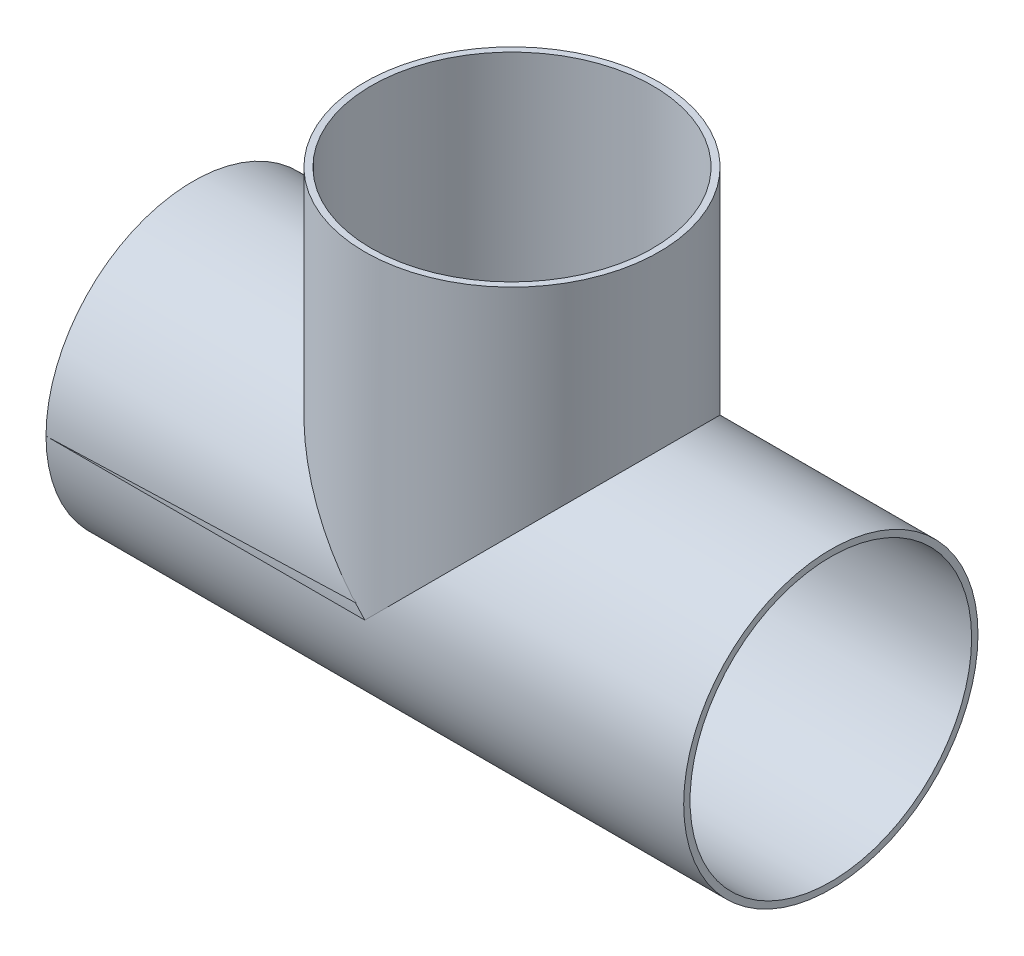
from build123d import *

# Parameters (mm, degrees)
SKETCH1_R           = 38.1
BOSS_EXTRUDE1_DEPTH = 82.55
SKETCH2_R           = 38.1
BOSS_EXTRUDE2_DEPTH = 82.55
SKETCH3_R           = 36.449
CUT_EXTRUDE1_DEPTH  = 82.55
SKETCH4_R           = 36.449
CUT_EXTRUDE2_DEPTH  = 189.478440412


with BuildPart() as part:
    # Sketch1 → Boss-Extrude1 (new body)
    with BuildSketch(Plane(origin=(0, 0, 0), x_dir=(1, 0, 0), z_dir=(0, 1, 0))):
        with Locations(Location((0, 0, 0), (0, 0, 270))):
            Circle(SKETCH1_R)
    extrude(amount=BOSS_EXTRUDE1_DEPTH)

    # Sketch2 → Boss-Extrude2 (add, symmetric)
    with BuildSketch(Plane(origin=(0, 0, 0), x_dir=(0, 0, -1), z_dir=(1, 0, 0))):
        Circle(SKETCH2_R)
    extrude(amount=BOSS_EXTRUDE2_DEPTH, both=True)

    # Sketch3 → Cut-Extrude1 (cut)
    with BuildSketch(Plane(origin=(0, 82.55, 0), x_dir=(1, 0, 0), z_dir=(0, 1, 0))):
        with Locations(Location((0, 0, 0), (0, 0, 270))):
            Circle(SKETCH3_R)
    extrude(amount=-CUT_EXTRUDE1_DEPTH, mode=Mode.SUBTRACT)

    # Sketch4 → Cut-Extrude2 (cut, through all)
    with BuildSketch(Plane(origin=(82.55, 0, 0), x_dir=(0, 0, -1), z_dir=(1, 0, 0))):
        Circle(SKETCH4_R)
    extrude(amount=-CUT_EXTRUDE2_DEPTH, mode=Mode.SUBTRACT)


solid = part.part
